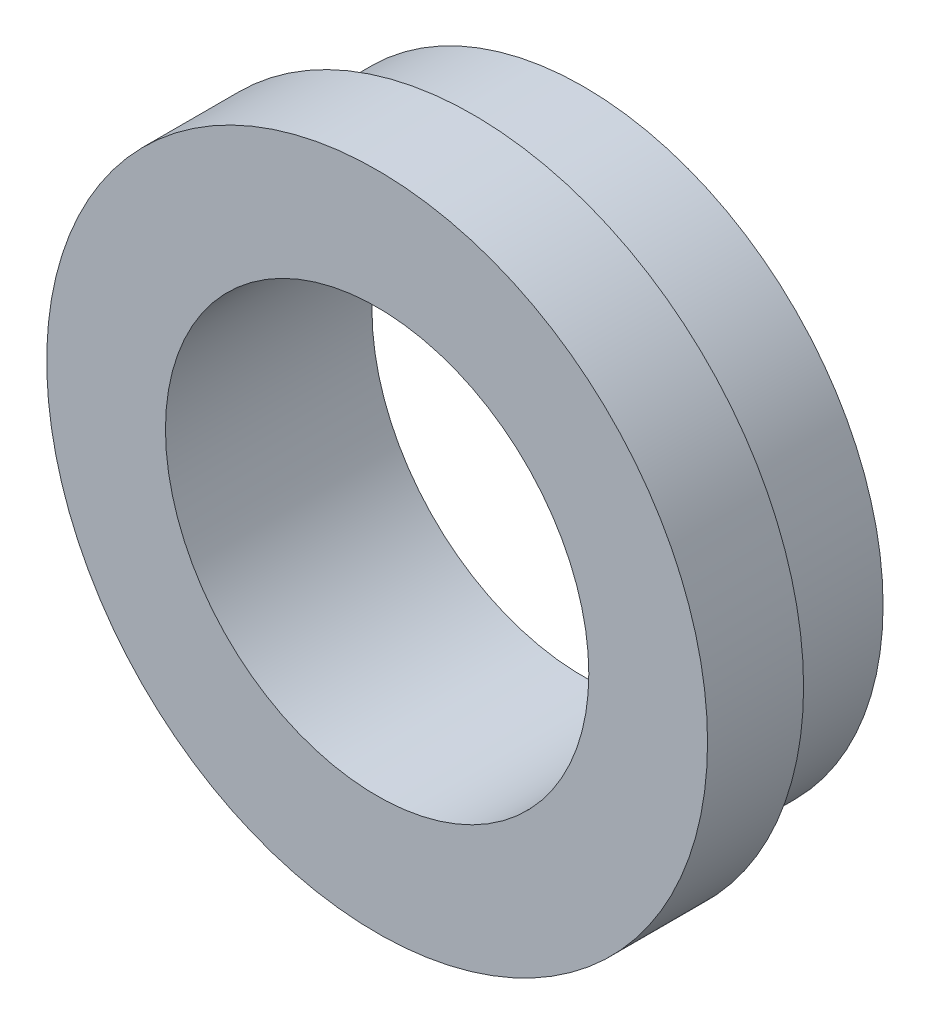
ISO-10303-21;
HEADER;
FILE_DESCRIPTION(('STEP AP214'),'2;1');
FILE_NAME('part.step','',(''),(''),'','','');
FILE_SCHEMA(('AUTOMOTIVE_DESIGN { 1 0 10303 214 1 1 1 1 }'));
ENDSEC;
DATA;
#1=APPLICATION_CONTEXT('core data for automotive mechanical design processes');
#2=APPLICATION_PROTOCOL_DEFINITION('international standard','automotive_design',2000,#1);
#3=PRODUCT_CONTEXT('',#1,'mechanical');
#4=PRODUCT('Part','Part','',(#3));
#5=PRODUCT_RELATED_PRODUCT_CATEGORY('part','',(#4));
#6=PRODUCT_DEFINITION_FORMATION('','',#4);
#7=PRODUCT_DEFINITION_CONTEXT('part definition',#1,'design');
#8=PRODUCT_DEFINITION('design','',#6,#7);
#9=PRODUCT_DEFINITION_SHAPE('','',#8);
#10=(LENGTH_UNIT() NAMED_UNIT(*) SI_UNIT(.MILLI.,.METRE.));
#11=(NAMED_UNIT(*) PLANE_ANGLE_UNIT() SI_UNIT($,.RADIAN.));
#12=(NAMED_UNIT(*) SI_UNIT($,.STERADIAN.) SOLID_ANGLE_UNIT());
#13=UNCERTAINTY_MEASURE_WITH_UNIT(LENGTH_MEASURE(1.E-05),#10,'distance_accuracy_value','');
#14=(GEOMETRIC_REPRESENTATION_CONTEXT(3) GLOBAL_UNCERTAINTY_ASSIGNED_CONTEXT((#13)) GLOBAL_UNIT_ASSIGNED_CONTEXT((#10,
#11,#12)) REPRESENTATION_CONTEXT('',''));
#15=CARTESIAN_POINT('',(0.,0.,0.));
#16=DIRECTION('',(0.,0.,1.));
#17=DIRECTION('',(1.,0.,0.));
#18=AXIS2_PLACEMENT_3D('',#15,#16,#17);
#19=CARTESIAN_POINT('',(0.,0.,-7.99999999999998));
#20=DIRECTION('',(0.,0.,-1.));
#21=DIRECTION('',(-1.,0.,0.));
#22=AXIS2_PLACEMENT_3D('',#19,#20,#21);
#23=CYLINDRICAL_SURFACE('',#22,16.);
#24=CARTESIAN_POINT('',(0.,0.,-7.99999999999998));
#25=DIRECTION('',(0.,0.,1.));
#26=DIRECTION('',(1.,0.,0.));
#27=AXIS2_PLACEMENT_3D('',#24,#25,#26);
#28=CIRCLE('',#27,16.);
#29=CARTESIAN_POINT('',(16.,0.,-7.99999999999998));
#30=VERTEX_POINT('',#29);
#31=EDGE_CURVE('E37',#30,#30,#28,.T.);
#32=ORIENTED_EDGE('',*,*,#31,.F.);
#33=EDGE_LOOP('',(#32));
#34=FACE_BOUND('',#33,.T.);
#35=CARTESIAN_POINT('',(0.,0.,-12.65));
#36=DIRECTION('',(0.,0.,1.));
#37=DIRECTION('',(1.,0.,0.));
#38=AXIS2_PLACEMENT_3D('',#35,#36,#37);
#39=CIRCLE('',#38,16.);
#40=CARTESIAN_POINT('',(16.,0.,-12.65));
#41=VERTEX_POINT('',#40);
#42=EDGE_CURVE('E41',#41,#41,#39,.T.);
#43=ORIENTED_EDGE('',*,*,#42,.T.);
#44=EDGE_LOOP('',(#43));
#45=FACE_BOUND('',#44,.T.);
#46=ADVANCED_FACE('F31',(#34,#45),#23,.T.);
#47=CARTESIAN_POINT('',(0.,0.,-7.99999999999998));
#48=DIRECTION('',(0.,0.,1.));
#49=DIRECTION('',(1.,0.,0.));
#50=AXIS2_PLACEMENT_3D('',#47,#48,#49);
#51=PLANE('',#50);
#52=CARTESIAN_POINT('',(0.,0.,-7.99999999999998));
#53=DIRECTION('',(0.,0.,-1.));
#54=DIRECTION('',(-1.,0.,0.));
#55=AXIS2_PLACEMENT_3D('',#52,#53,#54);
#56=CIRCLE('',#55,10.25);
#57=CARTESIAN_POINT('',(-10.25,0.,-7.99999999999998));
#58=VERTEX_POINT('',#57);
#59=EDGE_CURVE('E50',#58,#58,#56,.T.);
#60=ORIENTED_EDGE('',*,*,#59,.T.);
#61=EDGE_LOOP('',(#60));
#62=FACE_BOUND('',#61,.T.);
#63=ORIENTED_EDGE('',*,*,#31,.T.);
#64=EDGE_LOOP('',(#63));
#65=FACE_BOUND('',#64,.T.);
#66=ADVANCED_FACE('F57',(#62,#65),#51,.T.);
#67=CARTESIAN_POINT('',(0.,0.,-12.65));
#68=DIRECTION('',(0.,0.,1.));
#69=DIRECTION('',(1.,0.,0.));
#70=AXIS2_PLACEMENT_3D('',#67,#68,#69);
#71=PLANE('',#70);
#72=CARTESIAN_POINT('',(0.,0.,-12.65));
#73=DIRECTION('',(0.,0.,1.));
#74=DIRECTION('',(1.,0.,0.));
#75=AXIS2_PLACEMENT_3D('',#72,#73,#74);
#76=CIRCLE('',#75,14.5);
#77=CARTESIAN_POINT('',(14.5,0.,-12.65));
#78=VERTEX_POINT('',#77);
#79=EDGE_CURVE('E10',#78,#78,#76,.F.);
#80=ORIENTED_EDGE('',*,*,#79,.F.);
#81=EDGE_LOOP('',(#80));
#82=FACE_BOUND('',#81,.T.);
#83=ORIENTED_EDGE('',*,*,#42,.F.);
#84=EDGE_LOOP('',(#83));
#85=FACE_BOUND('',#84,.T.);
#86=ADVANCED_FACE('F73',(#82,#85),#71,.F.);
#87=CARTESIAN_POINT('',(0.,0.,-18.));
#88=DIRECTION('',(0.,0.,1.));
#89=DIRECTION('',(1.,0.,0.));
#90=AXIS2_PLACEMENT_3D('',#87,#88,#89);
#91=CYLINDRICAL_SURFACE('',#90,14.5);
#92=CARTESIAN_POINT('',(0.,0.,-18.));
#93=DIRECTION('',(0.,0.,-1.));
#94=DIRECTION('',(-1.,0.,0.));
#95=AXIS2_PLACEMENT_3D('',#92,#93,#94);
#96=CIRCLE('',#95,14.5);
#97=CARTESIAN_POINT('',(-14.5,0.,-18.));
#98=VERTEX_POINT('',#97);
#99=EDGE_CURVE('E46',#98,#98,#96,.T.);
#100=ORIENTED_EDGE('',*,*,#99,.F.);
#101=EDGE_LOOP('',(#100));
#102=FACE_BOUND('',#101,.T.);
#103=ORIENTED_EDGE('',*,*,#79,.T.);
#104=EDGE_LOOP('',(#103));
#105=FACE_BOUND('',#104,.T.);
#106=ADVANCED_FACE('F68',(#102,#105),#91,.T.);
#107=CARTESIAN_POINT('',(0.,0.,-18.));
#108=DIRECTION('',(0.,0.,-1.));
#109=DIRECTION('',(-1.,0.,0.));
#110=AXIS2_PLACEMENT_3D('',#107,#108,#109);
#111=PLANE('',#110);
#112=CARTESIAN_POINT('',(0.,0.,-18.));
#113=DIRECTION('',(0.,0.,-1.));
#114=DIRECTION('',(-1.,0.,0.));
#115=AXIS2_PLACEMENT_3D('',#112,#113,#114);
#116=CIRCLE('',#115,10.25);
#117=CARTESIAN_POINT('',(-10.25,0.,-18.));
#118=VERTEX_POINT('',#117);
#119=EDGE_CURVE('E51',#118,#118,#116,.T.);
#120=ORIENTED_EDGE('',*,*,#119,.F.);
#121=EDGE_LOOP('',(#120));
#122=FACE_BOUND('',#121,.T.);
#123=ORIENTED_EDGE('',*,*,#99,.T.);
#124=EDGE_LOOP('',(#123));
#125=FACE_BOUND('',#124,.T.);
#126=ADVANCED_FACE('F62',(#122,#125),#111,.T.);
#127=CARTESIAN_POINT('',(0.,0.,-7.99999999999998));
#128=DIRECTION('',(0.,0.,-1.));
#129=DIRECTION('',(-1.,0.,0.));
#130=AXIS2_PLACEMENT_3D('',#127,#128,#129);
#131=CYLINDRICAL_SURFACE('',#130,10.25);
#132=ORIENTED_EDGE('',*,*,#59,.F.);
#133=EDGE_LOOP('',(#132));
#134=FACE_BOUND('',#133,.T.);
#135=ORIENTED_EDGE('',*,*,#119,.T.);
#136=EDGE_LOOP('',(#135));
#137=FACE_BOUND('',#136,.T.);
#138=ADVANCED_FACE('F59',(#134,#137),#131,.F.);
#139=CLOSED_SHELL('',(#46,#66,#86,#106,#126,#138));
#140=MANIFOLD_SOLID_BREP('B2',#139);
#141=ADVANCED_BREP_SHAPE_REPRESENTATION('',(#18,#140),#14);
#142=SHAPE_DEFINITION_REPRESENTATION(#9,#141);
ENDSEC;
END-ISO-10303-21;
